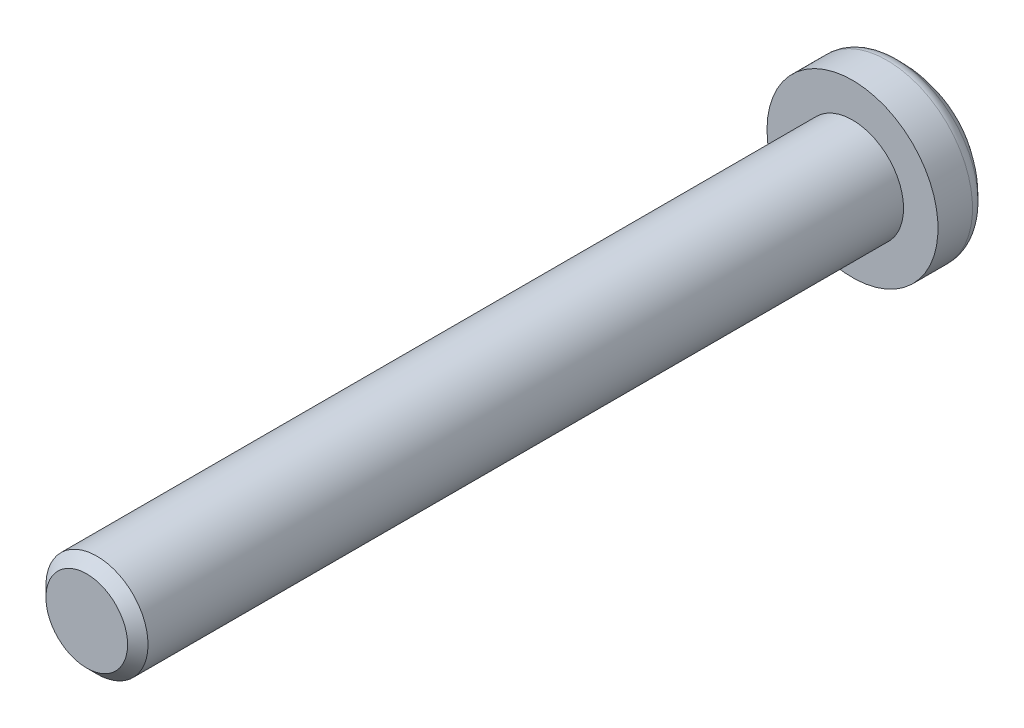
from build123d import *

# Parameters (mm, degrees)
ENLEV_MAT_EXTRU_1_DEPTH = 1
ESQUISSE3_W             = 2
ESQUISSE3_H             = 30
CHANFREIN1_SIZE         = 0.4


with BuildPart() as part:
    # Esquisse1 → Base-R_volution (revolve)
    with BuildSketch(Plane(origin=(0, 0, 0), x_dir=(1, 0, 0), z_dir=(0, 1, 0)), mode=Mode.PRIVATE) as base_r_volution_sk:
        with BuildLine():
            Line((0, 0), (3.35, 0))
            Line((3.35, 0), (3.35, 1.353412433))
            ThreePointArc((3.35, 1.353412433), (3.313933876, 1.543063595), (3.210770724, 1.706237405))
            ThreePointArc((3.210770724, 1.706237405), (1.750115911, 2.736530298), (0, 3.1))
            Line((0, 3.1), (0, 0))
        make_face()
    revolve(base_r_volution_sk.sketch.rotate(Axis((0, 0, 0), (0, 0, -1)), 180), axis=Axis((0, 0, 0), (0, 0, -1)))

    # Esquisse2 → Enlev. mat.-Extru.1 (cut)
    with BuildSketch(Plane.XY.offset(-3.1)):
        Polygon((0.6, -0.6), (0.6, -2.35), (-0.6, -2.35), (-0.6, -0.6), (-2.35, -0.6), (-2.35, 0.6), (-0.6, 0.6), (-0.6, 2.35), (0.6, 2.35), (0.6, 0.6), (2.35, 0.6), (2.35, -0.6), align=None)
    extrude(amount=ENLEV_MAT_EXTRU_1_DEPTH, mode=Mode.SUBTRACT)

    # Esquisse3 → Boss.-R_vol.1 (revolve)
    with BuildSketch(Plane(origin=(0, 0, 0), x_dir=(1, 0, 0), z_dir=(0, 1, 0)), mode=Mode.PRIVATE) as boss_r_vol_1_sk:
        with Locations((1, -15)):
            Rectangle(ESQUISSE3_W, ESQUISSE3_H)
    revolve(boss_r_vol_1_sk.sketch.rotate(Axis((0, 0, 0), (0, 0, 1)), 345.677280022), axis=Axis((0, 0, 0), (0, 0, 1)))

    # Chanfrein1
    chanfrein1_edges = [part.edges().sort_by_distance(p)[0] for p in [
        (-1.937835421, 0.494766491, 30),
    ]]
    chamfer(chanfrein1_edges, length=CHANFREIN1_SIZE)


solid = part.part
